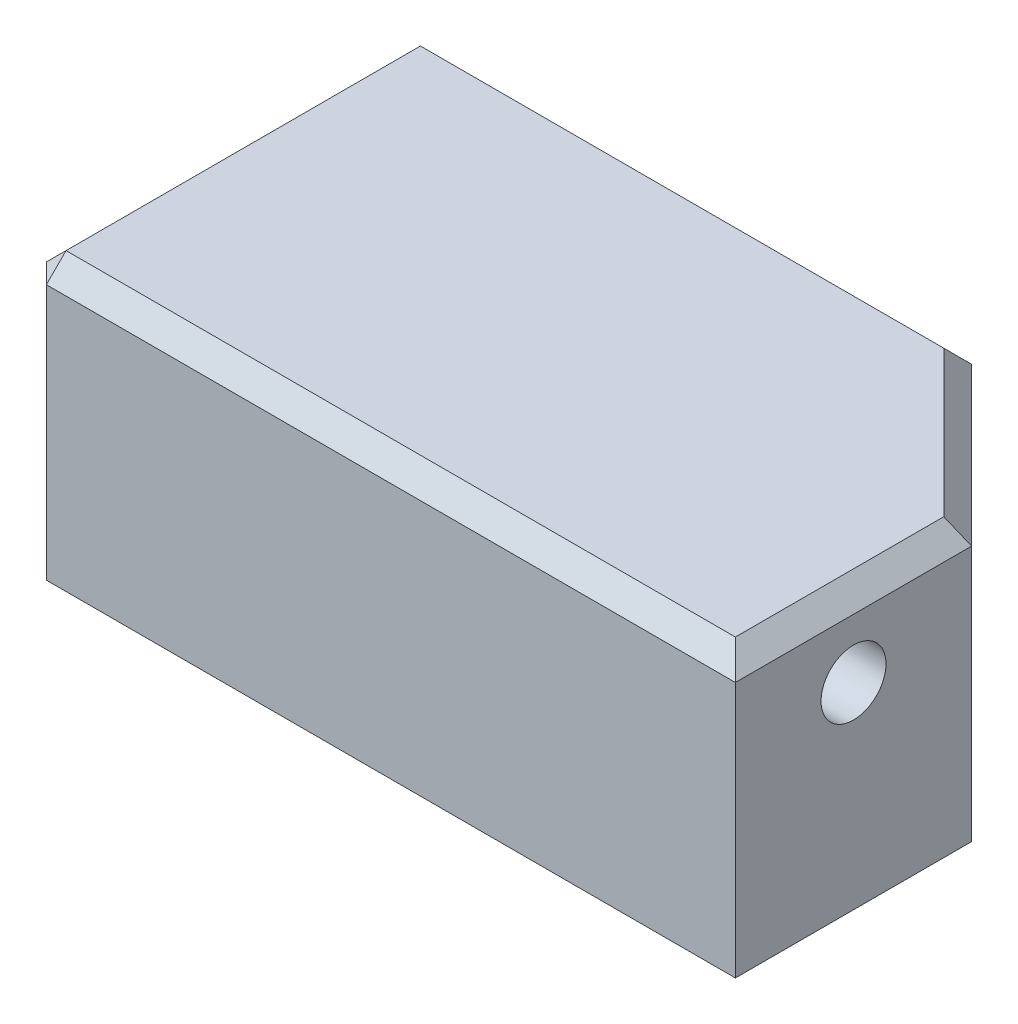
ISO-10303-21;
HEADER;
FILE_DESCRIPTION(('STEP AP214'),'2;1');
FILE_NAME('part.step','',(''),(''),'','','');
FILE_SCHEMA(('AUTOMOTIVE_DESIGN { 1 0 10303 214 1 1 1 1 }'));
ENDSEC;
DATA;
#1=APPLICATION_CONTEXT('core data for automotive mechanical design processes');
#2=APPLICATION_PROTOCOL_DEFINITION('international standard','automotive_design',2000,#1);
#3=PRODUCT_CONTEXT('',#1,'mechanical');
#4=PRODUCT('Part','Part','',(#3));
#5=PRODUCT_RELATED_PRODUCT_CATEGORY('part','',(#4));
#6=PRODUCT_DEFINITION_FORMATION('','',#4);
#7=PRODUCT_DEFINITION_CONTEXT('part definition',#1,'design');
#8=PRODUCT_DEFINITION('design','',#6,#7);
#9=PRODUCT_DEFINITION_SHAPE('','',#8);
#10=(LENGTH_UNIT() NAMED_UNIT(*) SI_UNIT(.MILLI.,.METRE.));
#11=(NAMED_UNIT(*) PLANE_ANGLE_UNIT() SI_UNIT($,.RADIAN.));
#12=(NAMED_UNIT(*) SI_UNIT($,.STERADIAN.) SOLID_ANGLE_UNIT());
#13=UNCERTAINTY_MEASURE_WITH_UNIT(LENGTH_MEASURE(1.E-05),#10,'distance_accuracy_value','');
#14=(GEOMETRIC_REPRESENTATION_CONTEXT(3) GLOBAL_UNCERTAINTY_ASSIGNED_CONTEXT((#13)) GLOBAL_UNIT_ASSIGNED_CONTEXT((#10,
#11,#12)) REPRESENTATION_CONTEXT('',''));
#15=CARTESIAN_POINT('',(0.,0.,0.));
#16=DIRECTION('',(0.,0.,1.));
#17=DIRECTION('',(1.,0.,0.));
#18=AXIS2_PLACEMENT_3D('',#15,#16,#17);
#19=CARTESIAN_POINT('',(18.,7.,0.));
#20=DIRECTION('',(0.,0.,-1.));
#21=DIRECTION('',(-1.,0.,0.));
#22=AXIS2_PLACEMENT_3D('',#19,#20,#21);
#23=PLANE('',#22);
#24=DIRECTION('',(0.,-1.,0.));
#25=VECTOR('',#24,1.);
#26=CARTESIAN_POINT('',(18.,7.,0.));
#27=LINE('',#26,#25);
#28=CARTESIAN_POINT('',(18.,6.5,0.));
#29=VERTEX_POINT('',#28);
#30=CARTESIAN_POINT('',(18.,0.,0.));
#31=VERTEX_POINT('',#30);
#32=EDGE_CURVE('E201',#29,#31,#27,.T.);
#33=ORIENTED_EDGE('',*,*,#32,.F.);
#34=DIRECTION('',(-1.,0.,0.));
#35=VECTOR('',#34,1.);
#36=CARTESIAN_POINT('',(18.,6.5,0.));
#37=LINE('',#36,#35);
#38=CARTESIAN_POINT('',(0.500000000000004,6.5,0.));
#39=VERTEX_POINT('',#38);
#40=EDGE_CURVE('E310',#29,#39,#37,.T.);
#41=ORIENTED_EDGE('',*,*,#40,.T.);
#42=DIRECTION('',(0.,-1.,0.));
#43=VECTOR('',#42,1.);
#44=CARTESIAN_POINT('',(0.500000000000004,7.,0.));
#45=LINE('',#44,#43);
#46=CARTESIAN_POINT('',(0.500000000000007,0.,0.));
#47=VERTEX_POINT('',#46);
#48=EDGE_CURVE('E307',#39,#47,#45,.T.);
#49=ORIENTED_EDGE('',*,*,#48,.T.);
#50=DIRECTION('',(1.,0.,0.));
#51=VECTOR('',#50,1.);
#52=CARTESIAN_POINT('',(18.,0.,0.));
#53=LINE('',#52,#51);
#54=EDGE_CURVE('E182',#47,#31,#53,.T.);
#55=ORIENTED_EDGE('',*,*,#54,.T.);
#56=EDGE_LOOP('',(#33,#41,#49,#55));
#57=FACE_BOUND('',#56,.T.);
#58=ADVANCED_FACE('F36',(#57),#23,.F.);
#59=CARTESIAN_POINT('',(18.,7.,-6.));
#60=DIRECTION('',(-1.,0.,0.));
#61=DIRECTION('',(0.,0.,1.));
#62=AXIS2_PLACEMENT_3D('',#59,#60,#61);
#63=PLANE('',#62);
#64=CARTESIAN_POINT('',(18.,5.,-3.));
#65=DIRECTION('',(1.,0.,0.));
#66=DIRECTION('',(0.,0.,-1.));
#67=AXIS2_PLACEMENT_3D('',#64,#65,#66);
#68=CIRCLE('',#67,0.824999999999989);
#69=CARTESIAN_POINT('',(18.,5.,-3.82499999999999));
#70=VERTEX_POINT('',#69);
#71=EDGE_CURVE('E176',#70,#70,#68,.T.);
#72=ORIENTED_EDGE('',*,*,#71,.F.);
#73=EDGE_LOOP('',(#72));
#74=FACE_BOUND('',#73,.T.);
#75=DIRECTION('',(0.,-1.,0.));
#76=VECTOR('',#75,1.);
#77=CARTESIAN_POINT('',(18.,7.,-6.));
#78=LINE('',#77,#76);
#79=CARTESIAN_POINT('',(18.,6.5,-6.));
#80=VERTEX_POINT('',#79);
#81=CARTESIAN_POINT('',(18.,0.,-6.));
#82=VERTEX_POINT('',#81);
#83=EDGE_CURVE('E199',#80,#82,#78,.T.);
#84=ORIENTED_EDGE('',*,*,#83,.F.);
#85=DIRECTION('',(0.,0.,1.));
#86=VECTOR('',#85,1.);
#87=CARTESIAN_POINT('',(18.,6.5,-6.));
#88=LINE('',#87,#86);
#89=EDGE_CURVE('E312',#80,#29,#88,.T.);
#90=ORIENTED_EDGE('',*,*,#89,.T.);
#91=ORIENTED_EDGE('',*,*,#32,.T.);
#92=DIRECTION('',(0.,0.,-1.));
#93=VECTOR('',#92,1.);
#94=CARTESIAN_POINT('',(18.,0.,-6.));
#95=LINE('',#94,#93);
#96=EDGE_CURVE('E184',#31,#82,#95,.T.);
#97=ORIENTED_EDGE('',*,*,#96,.T.);
#98=EDGE_LOOP('',(#84,#90,#91,#97));
#99=FACE_BOUND('',#98,.T.);
#100=ADVANCED_FACE('F253',(#74,#99),#63,.F.);
#101=CARTESIAN_POINT('',(14.,7.,-10.));
#102=DIRECTION('',(-0.707106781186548,0.,0.707106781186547));
#103=DIRECTION('',(0.707106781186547,0.,0.707106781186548));
#104=AXIS2_PLACEMENT_3D('',#101,#102,#103);
#105=PLANE('',#104);
#106=DIRECTION('',(0.,-1.,0.));
#107=VECTOR('',#106,1.);
#108=CARTESIAN_POINT('',(14.,7.,-10.));
#109=LINE('',#108,#107);
#110=CARTESIAN_POINT('',(14.,6.5,-10.));
#111=VERTEX_POINT('',#110);
#112=CARTESIAN_POINT('',(14.,0.,-10.));
#113=VERTEX_POINT('',#112);
#114=EDGE_CURVE('E197',#111,#113,#109,.T.);
#115=ORIENTED_EDGE('',*,*,#114,.F.);
#116=DIRECTION('',(0.707106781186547,0.,0.707106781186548));
#117=VECTOR('',#116,1.);
#118=CARTESIAN_POINT('',(14.,6.5,-10.));
#119=LINE('',#118,#117);
#120=EDGE_CURVE('E308',#111,#80,#119,.T.);
#121=ORIENTED_EDGE('',*,*,#120,.T.);
#122=ORIENTED_EDGE('',*,*,#83,.T.);
#123=DIRECTION('',(-0.707106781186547,0.,-0.707106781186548));
#124=VECTOR('',#123,1.);
#125=CARTESIAN_POINT('',(14.,0.,-10.));
#126=LINE('',#125,#124);
#127=EDGE_CURVE('E187',#82,#113,#126,.T.);
#128=ORIENTED_EDGE('',*,*,#127,.T.);
#129=EDGE_LOOP('',(#115,#121,#122,#128));
#130=FACE_BOUND('',#129,.T.);
#131=ADVANCED_FACE('F249',(#130),#105,.F.);
#132=CARTESIAN_POINT('',(0.,7.,-10.));
#133=DIRECTION('',(0.,0.,1.));
#134=DIRECTION('',(1.,0.,0.));
#135=AXIS2_PLACEMENT_3D('',#132,#133,#134);
#136=PLANE('',#135);
#137=CARTESIAN_POINT('',(3.,5.,-10.));
#138=DIRECTION('',(0.,0.,-1.));
#139=DIRECTION('',(-1.,0.,0.));
#140=AXIS2_PLACEMENT_3D('',#137,#138,#139);
#141=CIRCLE('',#140,0.824999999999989);
#142=CARTESIAN_POINT('',(2.17500000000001,5.,-10.));
#143=VERTEX_POINT('',#142);
#144=EDGE_CURVE('E167',#143,#143,#141,.T.);
#145=ORIENTED_EDGE('',*,*,#144,.F.);
#146=EDGE_LOOP('',(#145));
#147=FACE_BOUND('',#146,.T.);
#148=CARTESIAN_POINT('',(11.,5.,-10.));
#149=DIRECTION('',(0.,0.,-1.));
#150=DIRECTION('',(-1.,0.,0.));
#151=AXIS2_PLACEMENT_3D('',#148,#149,#150);
#152=CIRCLE('',#151,0.824999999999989);
#153=CARTESIAN_POINT('',(10.175,5.,-10.));
#154=VERTEX_POINT('',#153);
#155=EDGE_CURVE('E173',#154,#154,#152,.T.);
#156=ORIENTED_EDGE('',*,*,#155,.F.);
#157=EDGE_LOOP('',(#156));
#158=FACE_BOUND('',#157,.T.);
#159=DIRECTION('',(0.,-1.,0.));
#160=VECTOR('',#159,1.);
#161=CARTESIAN_POINT('',(0.,7.,-10.));
#162=LINE('',#161,#160);
#163=CARTESIAN_POINT('',(0.,6.5,-10.));
#164=VERTEX_POINT('',#163);
#165=CARTESIAN_POINT('',(0.,0.,-10.));
#166=VERTEX_POINT('',#165);
#167=EDGE_CURVE('E195',#164,#166,#162,.T.);
#168=ORIENTED_EDGE('',*,*,#167,.F.);
#169=DIRECTION('',(1.,0.,0.));
#170=VECTOR('',#169,1.);
#171=CARTESIAN_POINT('',(0.,6.5,-10.));
#172=LINE('',#171,#170);
#173=EDGE_CURVE('E300',#164,#111,#172,.T.);
#174=ORIENTED_EDGE('',*,*,#173,.T.);
#175=ORIENTED_EDGE('',*,*,#114,.T.);
#176=DIRECTION('',(-1.,0.,0.));
#177=VECTOR('',#176,1.);
#178=CARTESIAN_POINT('',(0.,0.,-10.));
#179=LINE('',#178,#177);
#180=EDGE_CURVE('E190',#113,#166,#179,.T.);
#181=ORIENTED_EDGE('',*,*,#180,.T.);
#182=EDGE_LOOP('',(#168,#174,#175,#181));
#183=FACE_BOUND('',#182,.T.);
#184=ADVANCED_FACE('F246',(#147,#158,#183),#136,.F.);
#185=CARTESIAN_POINT('',(0.,7.,0.));
#186=DIRECTION('',(1.,0.,0.));
#187=DIRECTION('',(0.,0.,-1.));
#188=AXIS2_PLACEMENT_3D('',#185,#186,#187);
#189=PLANE('',#188);
#190=DIRECTION('',(0.,1.,0.));
#191=VECTOR('',#190,1.);
#192=CARTESIAN_POINT('',(0.,7.,-0.5));
#193=LINE('',#192,#191);
#194=CARTESIAN_POINT('',(0.,0.,-0.5));
#195=VERTEX_POINT('',#194);
#196=CARTESIAN_POINT('',(0.,6.5,-0.5));
#197=VERTEX_POINT('',#196);
#198=EDGE_CURVE('E53',#195,#197,#193,.T.);
#199=ORIENTED_EDGE('',*,*,#198,.T.);
#200=DIRECTION('',(0.,0.,-1.));
#201=VECTOR('',#200,1.);
#202=CARTESIAN_POINT('',(0.,6.5,0.));
#203=LINE('',#202,#201);
#204=EDGE_CURVE('E45',#197,#164,#203,.T.);
#205=ORIENTED_EDGE('',*,*,#204,.T.);
#206=ORIENTED_EDGE('',*,*,#167,.T.);
#207=DIRECTION('',(0.,0.,1.));
#208=VECTOR('',#207,1.);
#209=CARTESIAN_POINT('',(0.,0.,0.));
#210=LINE('',#209,#208);
#211=EDGE_CURVE('E193',#166,#195,#210,.T.);
#212=ORIENTED_EDGE('',*,*,#211,.T.);
#213=EDGE_LOOP('',(#199,#205,#206,#212));
#214=FACE_BOUND('',#213,.T.);
#215=ADVANCED_FACE('F239',(#214),#189,.F.);
#216=CARTESIAN_POINT('',(0.,7.,0.));
#217=DIRECTION('',(0.,-1.,0.));
#218=DIRECTION('',(0.,0.,-1.));
#219=AXIS2_PLACEMENT_3D('',#216,#217,#218);
#220=PLANE('',#219);
#221=DIRECTION('',(1.,0.,0.));
#222=VECTOR('',#221,1.);
#223=CARTESIAN_POINT('',(0.,7.,-0.5));
#224=LINE('',#223,#222);
#225=CARTESIAN_POINT('',(0.500000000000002,7.,-0.5));
#226=VERTEX_POINT('',#225);
#227=CARTESIAN_POINT('',(17.5,7.,-0.500000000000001));
#228=VERTEX_POINT('',#227);
#229=EDGE_CURVE('E333',#226,#228,#224,.T.);
#230=ORIENTED_EDGE('',*,*,#229,.T.);
#231=DIRECTION('',(0.,0.,-1.));
#232=VECTOR('',#231,1.);
#233=CARTESIAN_POINT('',(17.5,7.,0.));
#234=LINE('',#233,#232);
#235=CARTESIAN_POINT('',(17.5,7.,-5.79289321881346));
#236=VERTEX_POINT('',#235);
#237=EDGE_CURVE('E344',#228,#236,#234,.T.);
#238=ORIENTED_EDGE('',*,*,#237,.T.);
#239=DIRECTION('',(-0.707106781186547,0.,-0.707106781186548));
#240=VECTOR('',#239,1.);
#241=CARTESIAN_POINT('',(11.6464466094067,7.,-11.6464466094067));
#242=LINE('',#241,#240);
#243=CARTESIAN_POINT('',(13.7928932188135,7.,-9.5));
#244=VERTEX_POINT('',#243);
#245=EDGE_CURVE('E338',#236,#244,#242,.T.);
#246=ORIENTED_EDGE('',*,*,#245,.T.);
#247=DIRECTION('',(-1.,0.,0.));
#248=VECTOR('',#247,1.);
#249=CARTESIAN_POINT('',(0.,7.,-9.5));
#250=LINE('',#249,#248);
#251=CARTESIAN_POINT('',(0.500000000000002,7.,-9.5));
#252=VERTEX_POINT('',#251);
#253=EDGE_CURVE('E336',#244,#252,#250,.T.);
#254=ORIENTED_EDGE('',*,*,#253,.T.);
#255=DIRECTION('',(0.,0.,1.));
#256=VECTOR('',#255,1.);
#257=CARTESIAN_POINT('',(0.500000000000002,7.,0.));
#258=LINE('',#257,#256);
#259=EDGE_CURVE('E294',#252,#226,#258,.T.);
#260=ORIENTED_EDGE('',*,*,#259,.T.);
#261=EDGE_LOOP('',(#230,#238,#246,#254,#260));
#262=FACE_BOUND('',#261,.T.);
#263=ADVANCED_FACE('F235',(#262),#220,.F.);
#264=CARTESIAN_POINT('',(0.,0.,0.));
#265=DIRECTION('',(0.,-1.,0.));
#266=DIRECTION('',(0.,0.,-1.));
#267=AXIS2_PLACEMENT_3D('',#264,#265,#266);
#268=PLANE('',#267);
#269=CARTESIAN_POINT('',(7.,0.,-7.));
#270=DIRECTION('',(0.,-1.,0.));
#271=DIRECTION('',(0.,0.,-1.));
#272=AXIS2_PLACEMENT_3D('',#269,#270,#271);
#273=CIRCLE('',#272,0.625);
#274=CARTESIAN_POINT('',(7.,0.,-7.625));
#275=VERTEX_POINT('',#274);
#276=EDGE_CURVE('E145',#275,#275,#273,.T.);
#277=ORIENTED_EDGE('',*,*,#276,.F.);
#278=EDGE_LOOP('',(#277));
#279=FACE_BOUND('',#278,.T.);
#280=CARTESIAN_POINT('',(15.,0.,-7.));
#281=DIRECTION('',(0.,-1.,0.));
#282=DIRECTION('',(0.,0.,-1.));
#283=AXIS2_PLACEMENT_3D('',#280,#281,#282);
#284=CIRCLE('',#283,0.624999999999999);
#285=CARTESIAN_POINT('',(15.,0.,-7.625));
#286=VERTEX_POINT('',#285);
#287=EDGE_CURVE('E144',#286,#286,#284,.T.);
#288=ORIENTED_EDGE('',*,*,#287,.F.);
#289=EDGE_LOOP('',(#288));
#290=FACE_BOUND('',#289,.T.);
#291=CARTESIAN_POINT('',(1.5,0.,-1.5));
#292=DIRECTION('',(0.,-1.,0.));
#293=DIRECTION('',(0.,0.,-1.));
#294=AXIS2_PLACEMENT_3D('',#291,#292,#293);
#295=CIRCLE('',#294,0.625);
#296=CARTESIAN_POINT('',(1.5,0.,-2.125));
#297=VERTEX_POINT('',#296);
#298=EDGE_CURVE('E155',#297,#297,#295,.T.);
#299=ORIENTED_EDGE('',*,*,#298,.F.);
#300=EDGE_LOOP('',(#299));
#301=FACE_BOUND('',#300,.T.);
#302=CARTESIAN_POINT('',(15.,0.,-1.5));
#303=DIRECTION('',(0.,-1.,0.));
#304=DIRECTION('',(0.,0.,-1.));
#305=AXIS2_PLACEMENT_3D('',#302,#303,#304);
#306=CIRCLE('',#305,0.624999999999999);
#307=CARTESIAN_POINT('',(15.,0.,-2.125));
#308=VERTEX_POINT('',#307);
#309=EDGE_CURVE('E161',#308,#308,#306,.T.);
#310=ORIENTED_EDGE('',*,*,#309,.F.);
#311=EDGE_LOOP('',(#310));
#312=FACE_BOUND('',#311,.T.);
#313=ORIENTED_EDGE('',*,*,#54,.F.);
#314=DIRECTION('',(0.70710678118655,0.,0.707106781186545));
#315=VECTOR('',#314,1.);
#316=CARTESIAN_POINT('',(0.25,0.,-0.250000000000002));
#317=LINE('',#316,#315);
#318=EDGE_CURVE('E11',#47,#195,#317,.F.);
#319=ORIENTED_EDGE('',*,*,#318,.T.);
#320=ORIENTED_EDGE('',*,*,#211,.F.);
#321=ORIENTED_EDGE('',*,*,#180,.F.);
#322=ORIENTED_EDGE('',*,*,#127,.F.);
#323=ORIENTED_EDGE('',*,*,#96,.F.);
#324=EDGE_LOOP('',(#313,#319,#320,#321,#322,#323));
#325=FACE_BOUND('',#324,.T.);
#326=ADVANCED_FACE('F233',(#279,#290,#301,#312,#325),#268,.T.);
#327=CARTESIAN_POINT('',(3.,5.,-3.));
#328=DIRECTION('',(1.,0.,0.));
#329=DIRECTION('',(0.,0.,-1.));
#330=AXIS2_PLACEMENT_3D('',#327,#328,#329);
#331=CONICAL_SURFACE('',#330,0.824999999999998,0.785398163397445);
#332=CARTESIAN_POINT('',(2.5875,5.,-2.5875));
#333=CARTESIAN_POINT('',(2.58749515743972,4.98861170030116,-2.58749515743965));
#334=CARTESIAN_POINT('',(2.58773324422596,4.97721942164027,-2.58773324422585));
#335=CARTESIAN_POINT('',(2.58962789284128,4.93173148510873,-2.58962789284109));
#336=CARTESIAN_POINT('',(2.59316826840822,4.8977595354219,-2.59316826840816));
#337=CARTESIAN_POINT('',(2.60411432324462,4.83107152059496,-2.60411432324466));
#338=CARTESIAN_POINT('',(2.61152830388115,4.79835831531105,-2.61152830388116));
#339=CARTESIAN_POINT('',(2.6334585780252,4.72086257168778,-2.63345857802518));
#340=CARTESIAN_POINT('',(2.64966242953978,4.67704471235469,-2.64966242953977));
#341=CARTESIAN_POINT('',(2.68670271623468,4.59322571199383,-2.68670271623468));
#342=CARTESIAN_POINT('',(2.70757428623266,4.55325699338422,-2.70757428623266));
#343=CARTESIAN_POINT('',(2.75175738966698,4.47808626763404,-2.75175738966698));
#344=CARTESIAN_POINT('',(2.77498311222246,4.44278134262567,-2.77498311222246));
#345=CARTESIAN_POINT('',(2.82350738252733,4.37505173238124,-2.82350738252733));
#346=CARTESIAN_POINT('',(2.84880984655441,4.34263274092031,-2.84880984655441));
#347=CARTESIAN_POINT('',(2.90004266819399,4.28124439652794,-2.90004266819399));
#348=CARTESIAN_POINT('',(2.92592757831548,4.25219819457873,-2.92592757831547));
#349=CARTESIAN_POINT('',(2.97862143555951,4.19618590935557,-2.97862143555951));
#350=CARTESIAN_POINT('',(3.00542570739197,4.1692110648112,-3.00542570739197));
#351=CARTESIAN_POINT('',(3.03258840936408,4.14303099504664,-3.03258840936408));
#352=B_SPLINE_CURVE_WITH_KNOTS('',3,(#332,#333,#334,#335,#336,#337,#338,#339,#340,#341,#342,
#343,#344,#345,#346,#347,#348,#349,#350,#351),.UNSPECIFIED.,.F.,.F.,(4,2,2,2,2,2,2,2,2,4),(0.,
0.0341720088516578,0.136630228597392,0.239308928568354,0.386807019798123,0.535455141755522,
0.679894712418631,0.824613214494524,0.9647365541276,1.10423019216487),.UNSPECIFIED.);
#353=CARTESIAN_POINT('',(3.,4.175,-3.));
#354=VERTEX_POINT('',#353);
#355=CARTESIAN_POINT('',(2.5875,5.,-2.5875));
#356=VERTEX_POINT('',#355);
#357=EDGE_CURVE('E210',#354,#356,#352,.F.);
#358=ORIENTED_EDGE('',*,*,#357,.T.);
#359=CARTESIAN_POINT('',(2.5875,5.,-2.5875));
#360=CARTESIAN_POINT('',(2.58749515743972,5.01138829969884,-2.58749515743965));
#361=CARTESIAN_POINT('',(2.58773324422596,5.02278057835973,-2.58773324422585));
#362=CARTESIAN_POINT('',(2.58962789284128,5.06826851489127,-2.58962789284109));
#363=CARTESIAN_POINT('',(2.59316826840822,5.1022404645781,-2.59316826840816));
#364=CARTESIAN_POINT('',(2.60411432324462,5.16892847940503,-2.60411432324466));
#365=CARTESIAN_POINT('',(2.61152830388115,5.20164168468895,-2.61152830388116));
#366=CARTESIAN_POINT('',(2.6334585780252,5.27913742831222,-2.63345857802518));
#367=CARTESIAN_POINT('',(2.64966242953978,5.32295528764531,-2.64966242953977));
#368=CARTESIAN_POINT('',(2.68670271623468,5.40677428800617,-2.68670271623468));
#369=CARTESIAN_POINT('',(2.70757428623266,5.44674300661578,-2.70757428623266));
#370=CARTESIAN_POINT('',(2.75175738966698,5.52191373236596,-2.75175738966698));
#371=CARTESIAN_POINT('',(2.77498311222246,5.55721865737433,-2.77498311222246));
#372=CARTESIAN_POINT('',(2.82350738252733,5.62494826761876,-2.82350738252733));
#373=CARTESIAN_POINT('',(2.84880984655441,5.65736725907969,-2.84880984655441));
#374=CARTESIAN_POINT('',(2.90004266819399,5.71875560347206,-2.90004266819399));
#375=CARTESIAN_POINT('',(2.92592757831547,5.74780180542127,-2.92592757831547));
#376=CARTESIAN_POINT('',(2.97862143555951,5.80381409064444,-2.97862143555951));
#377=CARTESIAN_POINT('',(3.00542570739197,5.8307889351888,-3.00542570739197));
#378=CARTESIAN_POINT('',(3.03258840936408,5.85696900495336,-3.03258840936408));
#379=B_SPLINE_CURVE_WITH_KNOTS('',3,(#359,#360,#361,#362,#363,#364,#365,#366,#367,#368,#369,
#370,#371,#372,#373,#374,#375,#376,#377,#378),.UNSPECIFIED.,.F.,.F.,(4,2,2,2,2,2,2,2,2,4),(0.,
0.0341720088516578,0.13663022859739,0.239308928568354,0.386807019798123,0.535455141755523,
0.679894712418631,0.824613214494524,0.9647365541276,1.10423019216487),.UNSPECIFIED.);
#380=CARTESIAN_POINT('',(3.,5.82499999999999,-3.));
#381=VERTEX_POINT('',#380);
#382=EDGE_CURVE('E218',#356,#381,#379,.T.);
#383=ORIENTED_EDGE('',*,*,#382,.T.);
#384=CARTESIAN_POINT('',(3.,5.,-3.));
#385=DIRECTION('',(1.,0.,0.));
#386=DIRECTION('',(0.,0.,-1.));
#387=AXIS2_PLACEMENT_3D('',#384,#385,#386);
#388=CIRCLE('',#387,0.824999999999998);
#389=EDGE_CURVE('E179',#381,#354,#388,.T.);
#390=ORIENTED_EDGE('',*,*,#389,.T.);
#391=EDGE_LOOP('',(#358,#383,#390));
#392=FACE_BOUND('',#391,.T.);
#393=ADVANCED_FACE('F227',(#392),#331,.F.);
#394=CARTESIAN_POINT('',(18.,5.,-3.));
#395=DIRECTION('',(1.,0.,0.));
#396=DIRECTION('',(0.,0.,-1.));
#397=AXIS2_PLACEMENT_3D('',#394,#395,#396);
#398=CYLINDRICAL_SURFACE('',#397,0.824999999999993);
#399=CARTESIAN_POINT('',(11.,5.,-3.));
#400=DIRECTION('',(0.707106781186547,0.,0.707106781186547));
#401=DIRECTION('',(0.707106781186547,0.,-0.707106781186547));
#402=AXIS2_PLACEMENT_3D('',#399,#400,#401);
#403=ELLIPSE('',#402,1.16672618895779,0.824999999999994);
#404=CARTESIAN_POINT('',(11.,5.82499999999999,-3.));
#405=VERTEX_POINT('',#404);
#406=CARTESIAN_POINT('',(10.9999999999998,4.17499999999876,-3.0000000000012));
#407=VERTEX_POINT('',#406);
#408=EDGE_CURVE('E204',#405,#407,#403,.F.);
#409=ORIENTED_EDGE('',*,*,#408,.T.);
#410=CARTESIAN_POINT('',(11.,5.,-3.));
#411=DIRECTION('',(0.707106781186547,0.,-0.707106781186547));
#412=DIRECTION('',(0.707106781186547,0.,0.707106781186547));
#413=AXIS2_PLACEMENT_3D('',#410,#411,#412);
#414=ELLIPSE('',#413,1.16672618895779,0.824999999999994);
#415=EDGE_CURVE('E207',#407,#405,#414,.T.);
#416=ORIENTED_EDGE('',*,*,#415,.T.);
#417=EDGE_LOOP('',(#409,#416));
#418=FACE_BOUND('',#417,.T.);
#419=CARTESIAN_POINT('',(11.,5.,-2.17500000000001));
#420=VERTEX_POINT('',#419);
#421=VERTEX_LOOP('',#420);
#422=FACE_BOUND('',#421,.T.);
#423=ORIENTED_EDGE('',*,*,#389,.F.);
#424=CARTESIAN_POINT('',(3.,5.,-3.));
#425=DIRECTION('',(0.707106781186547,0.,0.707106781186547));
#426=DIRECTION('',(0.707106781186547,0.,-0.707106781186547));
#427=AXIS2_PLACEMENT_3D('',#424,#425,#426);
#428=ELLIPSE('',#427,1.16672618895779,0.824999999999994);
#429=EDGE_CURVE('E340',#381,#354,#428,.F.);
#430=ORIENTED_EDGE('',*,*,#429,.T.);
#431=EDGE_LOOP('',(#423,#430));
#432=FACE_BOUND('',#431,.T.);
#433=ORIENTED_EDGE('',*,*,#71,.T.);
#434=EDGE_LOOP('',(#433));
#435=FACE_BOUND('',#434,.T.);
#436=ADVANCED_FACE('F232',(#418,#422,#432,#435),#398,.F.);
#437=CARTESIAN_POINT('',(11.,5.,-10.));
#438=DIRECTION('',(0.,0.,-1.));
#439=DIRECTION('',(-1.,0.,0.));
#440=AXIS2_PLACEMENT_3D('',#437,#438,#439);
#441=CYLINDRICAL_SURFACE('',#440,0.824999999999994);
#442=ORIENTED_EDGE('',*,*,#155,.T.);
#443=EDGE_LOOP('',(#442));
#444=FACE_BOUND('',#443,.T.);
#445=ORIENTED_EDGE('',*,*,#408,.F.);
#446=ORIENTED_EDGE('',*,*,#415,.F.);
#447=EDGE_LOOP('',(#445,#446));
#448=FACE_BOUND('',#447,.T.);
#449=ADVANCED_FACE('F362',(#444,#448),#441,.F.);
#450=CARTESIAN_POINT('',(3.,5.,-10.));
#451=DIRECTION('',(0.,0.,-1.));
#452=DIRECTION('',(-1.,0.,0.));
#453=AXIS2_PLACEMENT_3D('',#450,#451,#452);
#454=CYLINDRICAL_SURFACE('',#453,0.824999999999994);
#455=ORIENTED_EDGE('',*,*,#144,.T.);
#456=EDGE_LOOP('',(#455));
#457=FACE_BOUND('',#456,.T.);
#458=CARTESIAN_POINT('',(3.,5.,-3.));
#459=DIRECTION('',(0.,0.,-1.));
#460=DIRECTION('',(-1.,0.,0.));
#461=AXIS2_PLACEMENT_3D('',#458,#459,#460);
#462=CIRCLE('',#461,0.824999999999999);
#463=EDGE_CURVE('E170',#354,#381,#462,.T.);
#464=ORIENTED_EDGE('',*,*,#463,.F.);
#465=ORIENTED_EDGE('',*,*,#429,.F.);
#466=EDGE_LOOP('',(#464,#465));
#467=FACE_BOUND('',#466,.T.);
#468=ADVANCED_FACE('F368',(#457,#467),#454,.F.);
#469=CARTESIAN_POINT('',(3.,5.,-3.));
#470=DIRECTION('',(0.,0.,-1.));
#471=DIRECTION('',(-1.,0.,0.));
#472=AXIS2_PLACEMENT_3D('',#469,#470,#471);
#473=CONICAL_SURFACE('',#472,0.824999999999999,0.785398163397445);
#474=ORIENTED_EDGE('',*,*,#463,.T.);
#475=ORIENTED_EDGE('',*,*,#382,.F.);
#476=ORIENTED_EDGE('',*,*,#357,.F.);
#477=EDGE_LOOP('',(#474,#475,#476));
#478=FACE_BOUND('',#477,.T.);
#479=ADVANCED_FACE('F223',(#478),#473,.F.);
#480=CARTESIAN_POINT('',(15.,3.5,-1.5));
#481=DIRECTION('',(0.,-1.,0.));
#482=DIRECTION('',(0.,0.,-1.));
#483=AXIS2_PLACEMENT_3D('',#480,#481,#482);
#484=CONICAL_SURFACE('',#483,0.624999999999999,1.02974425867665);
#485=CARTESIAN_POINT('',(15.,3.87553788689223,-1.5));
#486=VERTEX_POINT('',#485);
#487=VERTEX_LOOP('',#486);
#488=FACE_BOUND('',#487,.T.);
#489=CARTESIAN_POINT('',(15.,3.5,-1.5));
#490=DIRECTION('',(0.,-1.,0.));
#491=DIRECTION('',(0.,0.,-1.));
#492=AXIS2_PLACEMENT_3D('',#489,#490,#491);
#493=CIRCLE('',#492,0.624999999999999);
#494=CARTESIAN_POINT('',(15.,3.5,-2.125));
#495=VERTEX_POINT('',#494);
#496=EDGE_CURVE('E164',#495,#495,#493,.T.);
#497=ORIENTED_EDGE('',*,*,#496,.T.);
#498=EDGE_LOOP('',(#497));
#499=FACE_BOUND('',#498,.T.);
#500=ADVANCED_FACE('F381',(#488,#499),#484,.F.);
#501=CARTESIAN_POINT('',(15.,0.,-1.5));
#502=DIRECTION('',(0.,-1.,0.));
#503=DIRECTION('',(0.,0.,-1.));
#504=AXIS2_PLACEMENT_3D('',#501,#502,#503);
#505=CYLINDRICAL_SURFACE('',#504,0.624999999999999);
#506=ORIENTED_EDGE('',*,*,#496,.F.);
#507=EDGE_LOOP('',(#506));
#508=FACE_BOUND('',#507,.T.);
#509=ORIENTED_EDGE('',*,*,#309,.T.);
#510=EDGE_LOOP('',(#509));
#511=FACE_BOUND('',#510,.T.);
#512=ADVANCED_FACE('F386',(#508,#511),#505,.F.);
#513=CARTESIAN_POINT('',(1.5,3.5,-1.5));
#514=DIRECTION('',(0.,-1.,0.));
#515=DIRECTION('',(0.,0.,-1.));
#516=AXIS2_PLACEMENT_3D('',#513,#514,#515);
#517=CONICAL_SURFACE('',#516,0.624999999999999,1.02974425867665);
#518=CARTESIAN_POINT('',(1.5,3.87553788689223,-1.5));
#519=VERTEX_POINT('',#518);
#520=VERTEX_LOOP('',#519);
#521=FACE_BOUND('',#520,.T.);
#522=CARTESIAN_POINT('',(1.5,3.5,-1.5));
#523=DIRECTION('',(0.,-1.,0.));
#524=DIRECTION('',(0.,0.,-1.));
#525=AXIS2_PLACEMENT_3D('',#522,#523,#524);
#526=CIRCLE('',#525,0.624999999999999);
#527=CARTESIAN_POINT('',(1.5,3.5,-2.125));
#528=VERTEX_POINT('',#527);
#529=EDGE_CURVE('E158',#528,#528,#526,.T.);
#530=ORIENTED_EDGE('',*,*,#529,.T.);
#531=EDGE_LOOP('',(#530));
#532=FACE_BOUND('',#531,.T.);
#533=ADVANCED_FACE('F390',(#521,#532),#517,.F.);
#534=CARTESIAN_POINT('',(1.5,0.,-1.5));
#535=DIRECTION('',(0.,-1.,0.));
#536=DIRECTION('',(0.,0.,-1.));
#537=AXIS2_PLACEMENT_3D('',#534,#535,#536);
#538=CYLINDRICAL_SURFACE('',#537,0.624999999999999);
#539=ORIENTED_EDGE('',*,*,#529,.F.);
#540=EDGE_LOOP('',(#539));
#541=FACE_BOUND('',#540,.T.);
#542=ORIENTED_EDGE('',*,*,#298,.T.);
#543=EDGE_LOOP('',(#542));
#544=FACE_BOUND('',#543,.T.);
#545=ADVANCED_FACE('F394',(#541,#544),#538,.F.);
#546=CARTESIAN_POINT('',(15.,3.5,-7.));
#547=DIRECTION('',(0.,-1.,0.));
#548=DIRECTION('',(0.,0.,-1.));
#549=AXIS2_PLACEMENT_3D('',#546,#547,#548);
#550=CONICAL_SURFACE('',#549,0.624999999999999,1.02974425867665);
#551=CARTESIAN_POINT('',(15.,3.87553788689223,-7.));
#552=VERTEX_POINT('',#551);
#553=VERTEX_LOOP('',#552);
#554=FACE_BOUND('',#553,.T.);
#555=CARTESIAN_POINT('',(15.,3.5,-7.));
#556=DIRECTION('',(0.,-1.,0.));
#557=DIRECTION('',(0.,0.,-1.));
#558=AXIS2_PLACEMENT_3D('',#555,#556,#557);
#559=CIRCLE('',#558,0.624999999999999);
#560=CARTESIAN_POINT('',(15.,3.5,-7.625));
#561=VERTEX_POINT('',#560);
#562=EDGE_CURVE('E148',#561,#561,#559,.T.);
#563=ORIENTED_EDGE('',*,*,#562,.T.);
#564=EDGE_LOOP('',(#563));
#565=FACE_BOUND('',#564,.T.);
#566=ADVANCED_FACE('F398',(#554,#565),#550,.F.);
#567=CARTESIAN_POINT('',(15.,0.,-7.));
#568=DIRECTION('',(0.,-1.,0.));
#569=DIRECTION('',(0.,0.,-1.));
#570=AXIS2_PLACEMENT_3D('',#567,#568,#569);
#571=CYLINDRICAL_SURFACE('',#570,0.624999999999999);
#572=ORIENTED_EDGE('',*,*,#562,.F.);
#573=EDGE_LOOP('',(#572));
#574=FACE_BOUND('',#573,.T.);
#575=ORIENTED_EDGE('',*,*,#287,.T.);
#576=EDGE_LOOP('',(#575));
#577=FACE_BOUND('',#576,.T.);
#578=ADVANCED_FACE('F138',(#574,#577),#571,.F.);
#579=CARTESIAN_POINT('',(7.,3.5,-7.));
#580=DIRECTION('',(0.,-1.,0.));
#581=DIRECTION('',(0.,0.,-1.));
#582=AXIS2_PLACEMENT_3D('',#579,#580,#581);
#583=CONICAL_SURFACE('',#582,0.624999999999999,1.02974425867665);
#584=CARTESIAN_POINT('',(7.,3.87553788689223,-7.));
#585=VERTEX_POINT('',#584);
#586=VERTEX_LOOP('',#585);
#587=FACE_BOUND('',#586,.T.);
#588=CARTESIAN_POINT('',(7.,3.5,-7.));
#589=DIRECTION('',(0.,-1.,0.));
#590=DIRECTION('',(0.,0.,-1.));
#591=AXIS2_PLACEMENT_3D('',#588,#589,#590);
#592=CIRCLE('',#591,0.624999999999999);
#593=CARTESIAN_POINT('',(7.,3.5,-7.625));
#594=VERTEX_POINT('',#593);
#595=EDGE_CURVE('E142',#594,#594,#592,.T.);
#596=ORIENTED_EDGE('',*,*,#595,.T.);
#597=EDGE_LOOP('',(#596));
#598=FACE_BOUND('',#597,.T.);
#599=ADVANCED_FACE('F134',(#587,#598),#583,.F.);
#600=CARTESIAN_POINT('',(7.,0.,-7.));
#601=DIRECTION('',(0.,-1.,0.));
#602=DIRECTION('',(0.,0.,-1.));
#603=AXIS2_PLACEMENT_3D('',#600,#601,#602);
#604=CYLINDRICAL_SURFACE('',#603,0.624999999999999);
#605=ORIENTED_EDGE('',*,*,#595,.F.);
#606=EDGE_LOOP('',(#605));
#607=FACE_BOUND('',#606,.T.);
#608=ORIENTED_EDGE('',*,*,#276,.T.);
#609=EDGE_LOOP('',(#608));
#610=FACE_BOUND('',#609,.T.);
#611=ADVANCED_FACE('F137',(#607,#610),#604,.F.);
#612=CARTESIAN_POINT('',(0.500000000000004,7.,0.));
#613=DIRECTION('',(0.707106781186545,0.,-0.70710678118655));
#614=DIRECTION('',(0.,-1.,0.));
#615=AXIS2_PLACEMENT_3D('',#612,#613,#614);
#616=PLANE('',#615);
#617=ORIENTED_EDGE('',*,*,#318,.F.);
#618=ORIENTED_EDGE('',*,*,#48,.F.);
#619=DIRECTION('',(-0.70710678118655,0.,-0.707106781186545));
#620=VECTOR('',#619,1.);
#621=CARTESIAN_POINT('',(0.500000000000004,6.5,0.));
#622=LINE('',#621,#620);
#623=EDGE_CURVE('E40',#197,#39,#622,.F.);
#624=ORIENTED_EDGE('',*,*,#623,.F.);
#625=ORIENTED_EDGE('',*,*,#198,.F.);
#626=EDGE_LOOP('',(#617,#618,#624,#625));
#627=FACE_BOUND('',#626,.T.);
#628=ADVANCED_FACE('F38',(#627),#616,.F.);
#629=CARTESIAN_POINT('',(0.500000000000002,7.,0.));
#630=DIRECTION('',(0.707106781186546,-0.707106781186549,0.));
#631=DIRECTION('',(0.,0.,1.));
#632=AXIS2_PLACEMENT_3D('',#629,#630,#631);
#633=PLANE('',#632);
#634=DIRECTION('',(-0.577350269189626,-0.577350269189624,-0.577350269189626));
#635=VECTOR('',#634,1.);
#636=CARTESIAN_POINT('',(3.66666666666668,10.1666666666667,-6.33333333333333));
#637=LINE('',#636,#635);
#638=EDGE_CURVE('E290',#164,#252,#637,.F.);
#639=ORIENTED_EDGE('',*,*,#638,.F.);
#640=ORIENTED_EDGE('',*,*,#204,.F.);
#641=DIRECTION('',(0.707106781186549,0.707106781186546,0.));
#642=VECTOR('',#641,1.);
#643=CARTESIAN_POINT('',(0.250000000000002,6.75,-0.5));
#644=LINE('',#643,#642);
#645=EDGE_CURVE('E296',#226,#197,#644,.F.);
#646=ORIENTED_EDGE('',*,*,#645,.F.);
#647=ORIENTED_EDGE('',*,*,#259,.F.);
#648=EDGE_LOOP('',(#639,#640,#646,#647));
#649=FACE_BOUND('',#648,.T.);
#650=ADVANCED_FACE('F279',(#649),#633,.F.);
#651=CARTESIAN_POINT('',(0.500000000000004,6.5,0.));
#652=DIRECTION('',(-0.577350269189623,0.577350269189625,0.577350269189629));
#653=DIRECTION('',(0.,-0.70710678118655,0.707106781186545));
#654=AXIS2_PLACEMENT_3D('',#651,#652,#653);
#655=PLANE('',#654);
#656=ORIENTED_EDGE('',*,*,#645,.T.);
#657=ORIENTED_EDGE('',*,*,#623,.T.);
#658=DIRECTION('',(0.,-0.707106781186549,0.707106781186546));
#659=VECTOR('',#658,1.);
#660=CARTESIAN_POINT('',(0.500000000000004,6.5,0.));
#661=LINE('',#660,#659);
#662=EDGE_CURVE('E297',#226,#39,#661,.T.);
#663=ORIENTED_EDGE('',*,*,#662,.F.);
#664=EDGE_LOOP('',(#656,#657,#663));
#665=FACE_BOUND('',#664,.T.);
#666=ADVANCED_FACE('F276',(#665),#655,.T.);
#667=CARTESIAN_POINT('',(0.,7.,-9.5));
#668=DIRECTION('',(0.,-0.707106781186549,0.707106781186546));
#669=DIRECTION('',(-1.,0.,0.));
#670=AXIS2_PLACEMENT_3D('',#667,#668,#669);
#671=PLANE('',#670);
#672=ORIENTED_EDGE('',*,*,#638,.T.);
#673=ORIENTED_EDGE('',*,*,#253,.F.);
#674=DIRECTION('',(0.281084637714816,-0.678598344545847,-0.678598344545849));
#675=VECTOR('',#674,1.);
#676=CARTESIAN_POINT('',(12.7031364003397,9.63090569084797,-6.86909430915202));
#677=LINE('',#676,#675);
#678=EDGE_CURVE('E302',#111,#244,#677,.F.);
#679=ORIENTED_EDGE('',*,*,#678,.F.);
#680=ORIENTED_EDGE('',*,*,#173,.F.);
#681=EDGE_LOOP('',(#672,#673,#679,#680));
#682=FACE_BOUND('',#681,.T.);
#683=ADVANCED_FACE('F272',(#682),#671,.F.);
#684=CARTESIAN_POINT('',(0.,7.,-0.5));
#685=DIRECTION('',(0.,-0.707106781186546,-0.707106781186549));
#686=DIRECTION('',(1.,0.,0.));
#687=AXIS2_PLACEMENT_3D('',#684,#685,#686);
#688=PLANE('',#687);
#689=ORIENTED_EDGE('',*,*,#662,.T.);
#690=ORIENTED_EDGE('',*,*,#40,.F.);
#691=DIRECTION('',(-0.577350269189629,0.577350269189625,-0.577350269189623));
#692=VECTOR('',#691,1.);
#693=CARTESIAN_POINT('',(11.6666666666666,12.8333333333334,-6.33333333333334));
#694=LINE('',#693,#692);
#695=EDGE_CURVE('E321',#228,#29,#694,.F.);
#696=ORIENTED_EDGE('',*,*,#695,.F.);
#697=ORIENTED_EDGE('',*,*,#229,.F.);
#698=EDGE_LOOP('',(#689,#690,#696,#697));
#699=FACE_BOUND('',#698,.T.);
#700=ADVANCED_FACE('F268',(#699),#688,.F.);
#701=CARTESIAN_POINT('',(11.6464466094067,7.,-11.6464466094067));
#702=DIRECTION('',(-0.500000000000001,-0.707106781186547,0.5));
#703=DIRECTION('',(-0.707106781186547,0.,-0.707106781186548));
#704=AXIS2_PLACEMENT_3D('',#701,#702,#703);
#705=PLANE('',#704);
#706=ORIENTED_EDGE('',*,*,#678,.T.);
#707=ORIENTED_EDGE('',*,*,#245,.F.);
#708=DIRECTION('',(0.678598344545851,-0.678598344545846,-0.281084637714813));
#709=VECTOR('',#708,1.);
#710=CARTESIAN_POINT('',(15.9209914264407,8.57900857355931,-5.13884645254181));
#711=LINE('',#710,#709);
#712=EDGE_CURVE('E319',#80,#236,#711,.F.);
#713=ORIENTED_EDGE('',*,*,#712,.F.);
#714=ORIENTED_EDGE('',*,*,#120,.F.);
#715=EDGE_LOOP('',(#706,#707,#713,#714));
#716=FACE_BOUND('',#715,.T.);
#717=ADVANCED_FACE('F264',(#716),#705,.F.);
#718=CARTESIAN_POINT('',(17.5,7.,0.));
#719=DIRECTION('',(-0.707106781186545,-0.70710678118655,0.));
#720=DIRECTION('',(0.,0.,-1.));
#721=AXIS2_PLACEMENT_3D('',#718,#719,#720);
#722=PLANE('',#721);
#723=ORIENTED_EDGE('',*,*,#695,.T.);
#724=ORIENTED_EDGE('',*,*,#89,.F.);
#725=ORIENTED_EDGE('',*,*,#712,.T.);
#726=ORIENTED_EDGE('',*,*,#237,.F.);
#727=EDGE_LOOP('',(#723,#724,#725,#726));
#728=FACE_BOUND('',#727,.T.);
#729=ADVANCED_FACE('F261',(#728),#722,.F.);
#730=CLOSED_SHELL('',(#58,#100,#131,#184,#215,#263,#326,#393,#436,#449,#468,#479,#500,#512,#533,
#545,#566,#578,#599,#611,#628,#650,#666,#683,#700,#717,#729));
#731=MANIFOLD_SOLID_BREP('B2',#730);
#732=ADVANCED_BREP_SHAPE_REPRESENTATION('',(#18,#731),#14);
#733=SHAPE_DEFINITION_REPRESENTATION(#9,#732);
ENDSEC;
END-ISO-10303-21;
